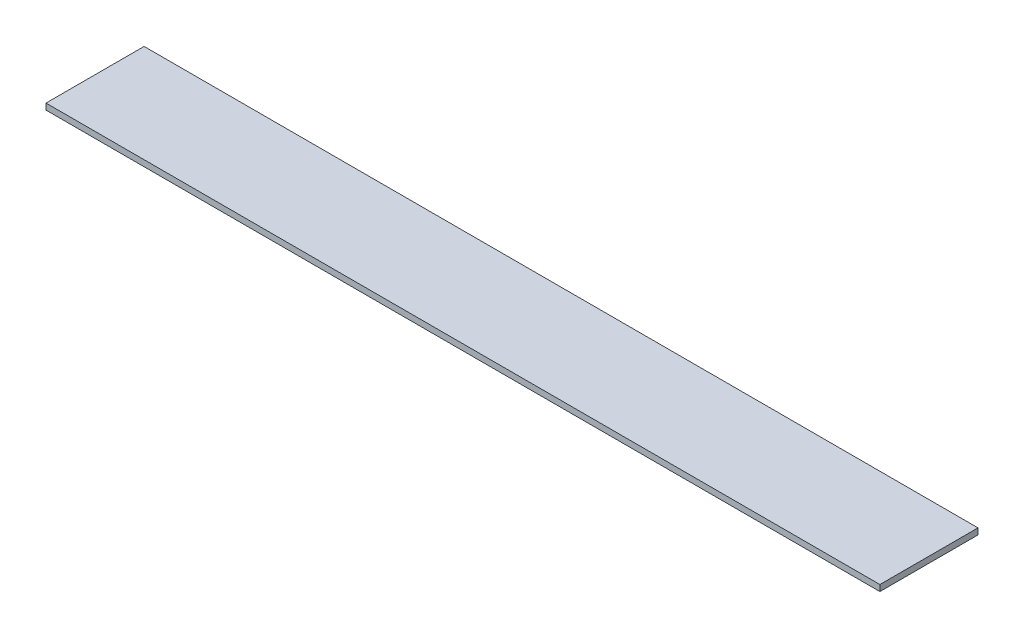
ISO-10303-21;
HEADER;
FILE_DESCRIPTION(('STEP AP214'),'2;1');
FILE_NAME('part.step','',(''),(''),'','','');
FILE_SCHEMA(('AUTOMOTIVE_DESIGN { 1 0 10303 214 1 1 1 1 }'));
ENDSEC;
DATA;
#1=APPLICATION_CONTEXT('core data for automotive mechanical design processes');
#2=APPLICATION_PROTOCOL_DEFINITION('international standard','automotive_design',2000,#1);
#3=PRODUCT_CONTEXT('',#1,'mechanical');
#4=PRODUCT('Part','Part','',(#3));
#5=PRODUCT_RELATED_PRODUCT_CATEGORY('part','',(#4));
#6=PRODUCT_DEFINITION_FORMATION('','',#4);
#7=PRODUCT_DEFINITION_CONTEXT('part definition',#1,'design');
#8=PRODUCT_DEFINITION('design','',#6,#7);
#9=PRODUCT_DEFINITION_SHAPE('','',#8);
#10=(LENGTH_UNIT() NAMED_UNIT(*) SI_UNIT(.MILLI.,.METRE.));
#11=(NAMED_UNIT(*) PLANE_ANGLE_UNIT() SI_UNIT($,.RADIAN.));
#12=(NAMED_UNIT(*) SI_UNIT($,.STERADIAN.) SOLID_ANGLE_UNIT());
#13=UNCERTAINTY_MEASURE_WITH_UNIT(LENGTH_MEASURE(1.E-05),#10,'distance_accuracy_value','');
#14=(GEOMETRIC_REPRESENTATION_CONTEXT(3) GLOBAL_UNCERTAINTY_ASSIGNED_CONTEXT((#13)) GLOBAL_UNIT_ASSIGNED_CONTEXT((#10,
#11,#12)) REPRESENTATION_CONTEXT('',''));
#15=CARTESIAN_POINT('',(0.,0.,0.));
#16=DIRECTION('',(0.,0.,1.));
#17=DIRECTION('',(1.,0.,0.));
#18=AXIS2_PLACEMENT_3D('',#15,#16,#17);
#19=CARTESIAN_POINT('',(215.9,3.175,25.4));
#20=DIRECTION('',(-1.,0.,0.));
#21=DIRECTION('',(0.,0.,1.));
#22=AXIS2_PLACEMENT_3D('',#19,#20,#21);
#23=PLANE('',#22);
#24=DIRECTION('',(0.,0.,-1.));
#25=VECTOR('',#24,1.);
#26=CARTESIAN_POINT('',(215.9,0.,25.4));
#27=LINE('',#26,#25);
#28=CARTESIAN_POINT('',(215.9,0.,25.4));
#29=VERTEX_POINT('',#28);
#30=CARTESIAN_POINT('',(215.9,0.,-25.4));
#31=VERTEX_POINT('',#30);
#32=EDGE_CURVE('E95',#29,#31,#27,.T.);
#33=ORIENTED_EDGE('',*,*,#32,.T.);
#34=DIRECTION('',(0.,-1.,0.));
#35=VECTOR('',#34,1.);
#36=CARTESIAN_POINT('',(215.9,3.175,-25.4));
#37=LINE('',#36,#35);
#38=CARTESIAN_POINT('',(215.9,3.175,-25.4));
#39=VERTEX_POINT('',#38);
#40=EDGE_CURVE('E11',#39,#31,#37,.T.);
#41=ORIENTED_EDGE('',*,*,#40,.F.);
#42=DIRECTION('',(0.,0.,-1.));
#43=VECTOR('',#42,1.);
#44=CARTESIAN_POINT('',(215.9,3.175,25.4));
#45=LINE('',#44,#43);
#46=CARTESIAN_POINT('',(215.9,3.175,25.4));
#47=VERTEX_POINT('',#46);
#48=EDGE_CURVE('E83',#47,#39,#45,.T.);
#49=ORIENTED_EDGE('',*,*,#48,.F.);
#50=DIRECTION('',(0.,-1.,0.));
#51=VECTOR('',#50,1.);
#52=CARTESIAN_POINT('',(215.9,3.175,25.4));
#53=LINE('',#52,#51);
#54=EDGE_CURVE('E91',#47,#29,#53,.T.);
#55=ORIENTED_EDGE('',*,*,#54,.T.);
#56=EDGE_LOOP('',(#33,#41,#49,#55));
#57=FACE_BOUND('',#56,.T.);
#58=ADVANCED_FACE('F32',(#57),#23,.F.);
#59=CARTESIAN_POINT('',(-215.9,3.175,-25.4));
#60=DIRECTION('',(0.,0.,1.));
#61=DIRECTION('',(1.,0.,0.));
#62=AXIS2_PLACEMENT_3D('',#59,#60,#61);
#63=PLANE('',#62);
#64=DIRECTION('',(-1.,0.,0.));
#65=VECTOR('',#64,1.);
#66=CARTESIAN_POINT('',(-215.9,0.,-25.4));
#67=LINE('',#66,#65);
#68=CARTESIAN_POINT('',(-215.9,0.,-25.4));
#69=VERTEX_POINT('',#68);
#70=EDGE_CURVE('E87',#31,#69,#67,.T.);
#71=ORIENTED_EDGE('',*,*,#70,.T.);
#72=DIRECTION('',(0.,-1.,0.));
#73=VECTOR('',#72,1.);
#74=CARTESIAN_POINT('',(-215.9,3.175,-25.4));
#75=LINE('',#74,#73);
#76=CARTESIAN_POINT('',(-215.9,3.175,-25.4));
#77=VERTEX_POINT('',#76);
#78=EDGE_CURVE('E40',#77,#69,#75,.T.);
#79=ORIENTED_EDGE('',*,*,#78,.F.);
#80=DIRECTION('',(-1.,0.,0.));
#81=VECTOR('',#80,1.);
#82=CARTESIAN_POINT('',(-215.9,3.175,-25.4));
#83=LINE('',#82,#81);
#84=EDGE_CURVE('E78',#39,#77,#83,.T.);
#85=ORIENTED_EDGE('',*,*,#84,.F.);
#86=ORIENTED_EDGE('',*,*,#40,.T.);
#87=EDGE_LOOP('',(#71,#79,#85,#86));
#88=FACE_BOUND('',#87,.T.);
#89=ADVANCED_FACE('F86',(#88),#63,.F.);
#90=CARTESIAN_POINT('',(-215.9,3.175,25.4));
#91=DIRECTION('',(1.,0.,0.));
#92=DIRECTION('',(0.,0.,-1.));
#93=AXIS2_PLACEMENT_3D('',#90,#91,#92);
#94=PLANE('',#93);
#95=DIRECTION('',(0.,0.,1.));
#96=VECTOR('',#95,1.);
#97=CARTESIAN_POINT('',(-215.9,0.,25.4));
#98=LINE('',#97,#96);
#99=CARTESIAN_POINT('',(-215.9,0.,25.4));
#100=VERTEX_POINT('',#99);
#101=EDGE_CURVE('E65',#69,#100,#98,.T.);
#102=ORIENTED_EDGE('',*,*,#101,.T.);
#103=DIRECTION('',(0.,-1.,0.));
#104=VECTOR('',#103,1.);
#105=CARTESIAN_POINT('',(-215.9,3.175,25.4));
#106=LINE('',#105,#104);
#107=CARTESIAN_POINT('',(-215.9,3.175,25.4));
#108=VERTEX_POINT('',#107);
#109=EDGE_CURVE('E88',#108,#100,#106,.T.);
#110=ORIENTED_EDGE('',*,*,#109,.F.);
#111=DIRECTION('',(0.,0.,1.));
#112=VECTOR('',#111,1.);
#113=CARTESIAN_POINT('',(-215.9,3.175,25.4));
#114=LINE('',#113,#112);
#115=EDGE_CURVE('E81',#77,#108,#114,.T.);
#116=ORIENTED_EDGE('',*,*,#115,.F.);
#117=ORIENTED_EDGE('',*,*,#78,.T.);
#118=EDGE_LOOP('',(#102,#110,#116,#117));
#119=FACE_BOUND('',#118,.T.);
#120=ADVANCED_FACE('F89',(#119),#94,.F.);
#121=CARTESIAN_POINT('',(-215.9,3.175,25.4));
#122=DIRECTION('',(0.,0.,-1.));
#123=DIRECTION('',(-1.,0.,0.));
#124=AXIS2_PLACEMENT_3D('',#121,#122,#123);
#125=PLANE('',#124);
#126=DIRECTION('',(1.,0.,0.));
#127=VECTOR('',#126,1.);
#128=CARTESIAN_POINT('',(-215.9,0.,25.4));
#129=LINE('',#128,#127);
#130=EDGE_CURVE('E71',#100,#29,#129,.T.);
#131=ORIENTED_EDGE('',*,*,#130,.T.);
#132=ORIENTED_EDGE('',*,*,#54,.F.);
#133=DIRECTION('',(1.,0.,0.));
#134=VECTOR('',#133,1.);
#135=CARTESIAN_POINT('',(-215.9,3.175,25.4));
#136=LINE('',#135,#134);
#137=EDGE_CURVE('E48',#108,#47,#136,.T.);
#138=ORIENTED_EDGE('',*,*,#137,.F.);
#139=ORIENTED_EDGE('',*,*,#109,.T.);
#140=EDGE_LOOP('',(#131,#132,#138,#139));
#141=FACE_BOUND('',#140,.T.);
#142=ADVANCED_FACE('F102',(#141),#125,.F.);
#143=CARTESIAN_POINT('',(0.,3.175,0.));
#144=DIRECTION('',(0.,-1.,0.));
#145=DIRECTION('',(0.,0.,-1.));
#146=AXIS2_PLACEMENT_3D('',#143,#144,#145);
#147=PLANE('',#146);
#148=ORIENTED_EDGE('',*,*,#48,.T.);
#149=ORIENTED_EDGE('',*,*,#84,.T.);
#150=ORIENTED_EDGE('',*,*,#115,.T.);
#151=ORIENTED_EDGE('',*,*,#137,.T.);
#152=EDGE_LOOP('',(#148,#149,#150,#151));
#153=FACE_BOUND('',#152,.T.);
#154=ADVANCED_FACE('F79',(#153),#147,.F.);
#155=CARTESIAN_POINT('',(0.,0.,0.));
#156=DIRECTION('',(0.,-1.,0.));
#157=DIRECTION('',(0.,0.,-1.));
#158=AXIS2_PLACEMENT_3D('',#155,#156,#157);
#159=PLANE('',#158);
#160=ORIENTED_EDGE('',*,*,#32,.F.);
#161=ORIENTED_EDGE('',*,*,#130,.F.);
#162=ORIENTED_EDGE('',*,*,#101,.F.);
#163=ORIENTED_EDGE('',*,*,#70,.F.);
#164=EDGE_LOOP('',(#160,#161,#162,#163));
#165=FACE_BOUND('',#164,.T.);
#166=ADVANCED_FACE('F105',(#165),#159,.T.);
#167=CLOSED_SHELL('',(#58,#89,#120,#142,#154,#166));
#168=MANIFOLD_SOLID_BREP('B2',#167);
#169=ADVANCED_BREP_SHAPE_REPRESENTATION('',(#18,#168),#14);
#170=SHAPE_DEFINITION_REPRESENTATION(#9,#169);
ENDSEC;
END-ISO-10303-21;
